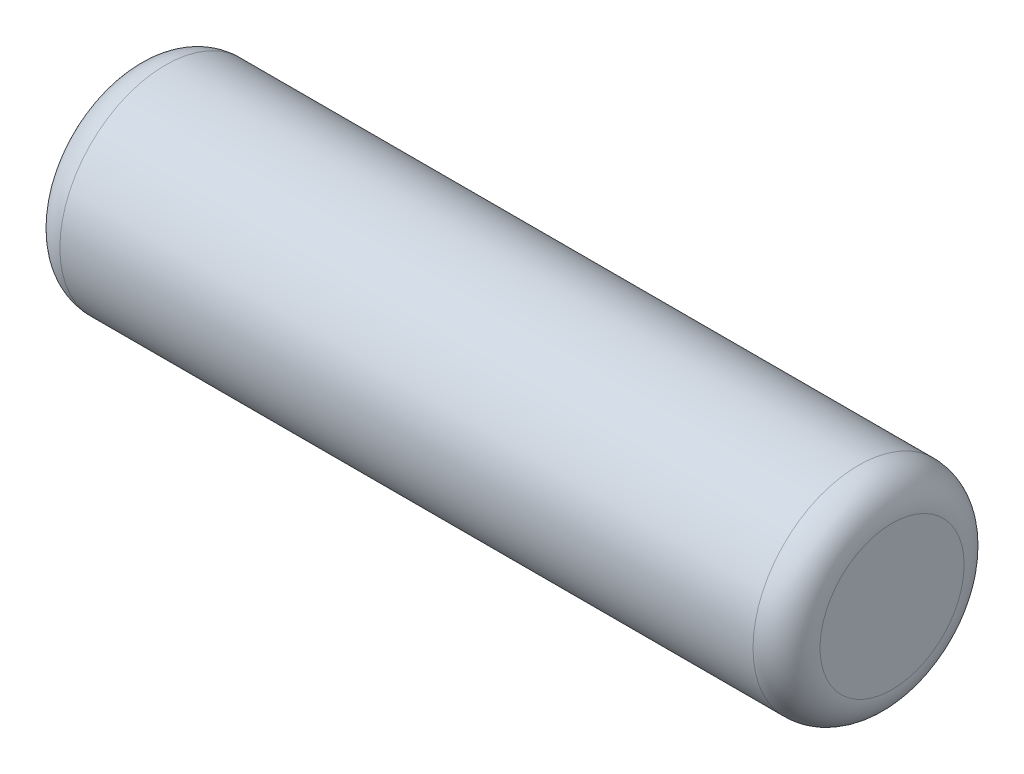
ISO-10303-21;
HEADER;
FILE_DESCRIPTION(('STEP AP214'),'2;1');
FILE_NAME('part.step','',(''),(''),'','','');
FILE_SCHEMA(('AUTOMOTIVE_DESIGN { 1 0 10303 214 1 1 1 1 }'));
ENDSEC;
DATA;
#1=APPLICATION_CONTEXT('core data for automotive mechanical design processes');
#2=APPLICATION_PROTOCOL_DEFINITION('international standard','automotive_design',2000,#1);
#3=PRODUCT_CONTEXT('',#1,'mechanical');
#4=PRODUCT('Part','Part','',(#3));
#5=PRODUCT_RELATED_PRODUCT_CATEGORY('part','',(#4));
#6=PRODUCT_DEFINITION_FORMATION('','',#4);
#7=PRODUCT_DEFINITION_CONTEXT('part definition',#1,'design');
#8=PRODUCT_DEFINITION('design','',#6,#7);
#9=PRODUCT_DEFINITION_SHAPE('','',#8);
#10=(LENGTH_UNIT() NAMED_UNIT(*) SI_UNIT(.MILLI.,.METRE.));
#11=(NAMED_UNIT(*) PLANE_ANGLE_UNIT() SI_UNIT($,.RADIAN.));
#12=(NAMED_UNIT(*) SI_UNIT($,.STERADIAN.) SOLID_ANGLE_UNIT());
#13=UNCERTAINTY_MEASURE_WITH_UNIT(LENGTH_MEASURE(1.E-05),#10,'distance_accuracy_value','');
#14=(GEOMETRIC_REPRESENTATION_CONTEXT(3) GLOBAL_UNCERTAINTY_ASSIGNED_CONTEXT((#13)) GLOBAL_UNIT_ASSIGNED_CONTEXT((#10,
#11,#12)) REPRESENTATION_CONTEXT('',''));
#15=CARTESIAN_POINT('',(0.,0.,0.));
#16=DIRECTION('',(0.,0.,1.));
#17=DIRECTION('',(1.,0.,0.));
#18=AXIS2_PLACEMENT_3D('',#15,#16,#17);
#19=CARTESIAN_POINT('',(110.,0.,0.));
#20=DIRECTION('',(-1.,0.,0.));
#21=DIRECTION('',(0.,0.,1.));
#22=AXIS2_PLACEMENT_3D('',#19,#20,#21);
#23=CYLINDRICAL_SURFACE('',#22,15.75);
#24=CARTESIAN_POINT('',(4.58257569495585,0.,0.));
#25=DIRECTION('',(-1.,0.,0.));
#26=DIRECTION('',(0.,0.,1.));
#27=AXIS2_PLACEMENT_3D('',#24,#25,#26);
#28=CIRCLE('',#27,15.75);
#29=CARTESIAN_POINT('',(4.58257569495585,0.,15.75));
#30=VERTEX_POINT('',#29);
#31=EDGE_CURVE('E10',#30,#30,#28,.F.);
#32=ORIENTED_EDGE('',*,*,#31,.T.);
#33=EDGE_LOOP('',(#32));
#34=FACE_BOUND('',#33,.T.);
#35=CARTESIAN_POINT('',(108.,0.,0.));
#36=DIRECTION('',(1.,0.,0.));
#37=DIRECTION('',(0.,0.,-1.));
#38=AXIS2_PLACEMENT_3D('',#35,#36,#37);
#39=CIRCLE('',#38,15.75);
#40=CARTESIAN_POINT('',(108.,0.,-15.75));
#41=VERTEX_POINT('',#40);
#42=EDGE_CURVE('E59',#41,#41,#39,.F.);
#43=ORIENTED_EDGE('',*,*,#42,.T.);
#44=EDGE_LOOP('',(#43));
#45=FACE_BOUND('',#44,.T.);
#46=ADVANCED_FACE('F41',(#34,#45),#23,.T.);
#47=CARTESIAN_POINT('',(110.,0.,0.));
#48=DIRECTION('',(-1.,0.,0.));
#49=DIRECTION('',(0.,0.,1.));
#50=AXIS2_PLACEMENT_3D('',#47,#48,#49);
#51=CYLINDRICAL_SURFACE('',#50,12.75);
#52=CARTESIAN_POINT('',(105.,0.,0.));
#53=DIRECTION('',(1.,0.,0.));
#54=DIRECTION('',(0.,0.,-1.));
#55=AXIS2_PLACEMENT_3D('',#52,#53,#54);
#56=CIRCLE('',#55,12.75);
#57=CARTESIAN_POINT('',(105.,0.,-12.75));
#58=VERTEX_POINT('',#57);
#59=EDGE_CURVE('E54',#58,#58,#56,.T.);
#60=ORIENTED_EDGE('',*,*,#59,.T.);
#61=EDGE_LOOP('',(#60));
#62=FACE_BOUND('',#61,.T.);
#63=CARTESIAN_POINT('',(0.,0.,0.));
#64=DIRECTION('',(1.,0.,0.));
#65=DIRECTION('',(0.,0.,-1.));
#66=AXIS2_PLACEMENT_3D('',#63,#64,#65);
#67=CIRCLE('',#66,12.75);
#68=CARTESIAN_POINT('',(0.,0.,-12.75));
#69=VERTEX_POINT('',#68);
#70=EDGE_CURVE('E69',#69,#69,#67,.T.);
#71=ORIENTED_EDGE('',*,*,#70,.F.);
#72=EDGE_LOOP('',(#71));
#73=FACE_BOUND('',#72,.T.);
#74=ADVANCED_FACE('F76',(#62,#73),#51,.F.);
#75=CARTESIAN_POINT('',(110.,0.,0.));
#76=DIRECTION('',(1.,0.,0.));
#77=DIRECTION('',(0.,0.,-1.));
#78=AXIS2_PLACEMENT_3D('',#75,#76,#77);
#79=PLANE('',#78);
#80=CARTESIAN_POINT('',(110.,0.,0.));
#81=DIRECTION('',(1.,0.,0.));
#82=DIRECTION('',(0.,0.,-1.));
#83=AXIS2_PLACEMENT_3D('',#80,#81,#82);
#84=CIRCLE('',#83,7.75);
#85=CARTESIAN_POINT('',(110.,0.,-7.75));
#86=VERTEX_POINT('',#85);
#87=EDGE_CURVE('E49',#86,#86,#84,.F.);
#88=ORIENTED_EDGE('',*,*,#87,.T.);
#89=EDGE_LOOP('',(#88));
#90=FACE_BOUND('',#89,.T.);
#91=ADVANCED_FACE('F78',(#90),#79,.F.);
#92=CARTESIAN_POINT('',(113.,0.,0.));
#93=DIRECTION('',(1.,0.,0.));
#94=DIRECTION('',(0.,0.,-1.));
#95=AXIS2_PLACEMENT_3D('',#92,#93,#94);
#96=PLANE('',#95);
#97=CARTESIAN_POINT('',(113.,0.,0.));
#98=DIRECTION('',(1.,0.,0.));
#99=DIRECTION('',(0.,0.,-1.));
#100=AXIS2_PLACEMENT_3D('',#97,#98,#99);
#101=CIRCLE('',#100,10.75);
#102=CARTESIAN_POINT('',(113.,0.,-10.75));
#103=VERTEX_POINT('',#102);
#104=EDGE_CURVE('E65',#103,#103,#101,.T.);
#105=ORIENTED_EDGE('',*,*,#104,.T.);
#106=EDGE_LOOP('',(#105));
#107=FACE_BOUND('',#106,.T.);
#108=ADVANCED_FACE('F85',(#107),#96,.T.);
#109=CARTESIAN_POINT('',(108.,0.,0.));
#110=DIRECTION('',(1.,0.,0.));
#111=DIRECTION('',(0.,0.,-1.));
#112=AXIS2_PLACEMENT_3D('',#109,#110,#111);
#113=TOROIDAL_SURFACE('',#112,10.75,5.);
#114=ORIENTED_EDGE('',*,*,#42,.F.);
#115=EDGE_LOOP('',(#114));
#116=FACE_BOUND('',#115,.T.);
#117=ORIENTED_EDGE('',*,*,#104,.F.);
#118=EDGE_LOOP('',(#117));
#119=FACE_BOUND('',#118,.T.);
#120=ADVANCED_FACE('F90',(#116,#119),#113,.T.);
#121=CARTESIAN_POINT('',(105.,0.,0.));
#122=DIRECTION('',(1.,0.,0.));
#123=DIRECTION('',(0.,0.,-1.));
#124=AXIS2_PLACEMENT_3D('',#121,#122,#123);
#125=TOROIDAL_SURFACE('',#124,7.75,5.);
#126=ORIENTED_EDGE('',*,*,#87,.F.);
#127=EDGE_LOOP('',(#126));
#128=FACE_BOUND('',#127,.T.);
#129=ORIENTED_EDGE('',*,*,#59,.F.);
#130=EDGE_LOOP('',(#129));
#131=FACE_BOUND('',#130,.T.);
#132=ADVANCED_FACE('F92',(#128,#131),#125,.F.);
#133=CARTESIAN_POINT('',(4.58257569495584,0.,0.));
#134=DIRECTION('',(-1.,0.,0.));
#135=DIRECTION('',(0.,0.,1.));
#136=AXIS2_PLACEMENT_3D('',#133,#134,#135);
#137=TOROIDAL_SURFACE('',#136,10.75,5.);
#138=ORIENTED_EDGE('',*,*,#70,.T.);
#139=EDGE_LOOP('',(#138));
#140=FACE_BOUND('',#139,.T.);
#141=ORIENTED_EDGE('',*,*,#31,.F.);
#142=EDGE_LOOP('',(#141));
#143=FACE_BOUND('',#142,.T.);
#144=ADVANCED_FACE('F43',(#140,#143),#137,.T.);
#145=CLOSED_SHELL('',(#46,#74,#91,#108,#120,#132,#144));
#146=MANIFOLD_SOLID_BREP('B2',#145);
#147=ADVANCED_BREP_SHAPE_REPRESENTATION('',(#18,#146),#14);
#148=SHAPE_DEFINITION_REPRESENTATION(#9,#147);
ENDSEC;
END-ISO-10303-21;
